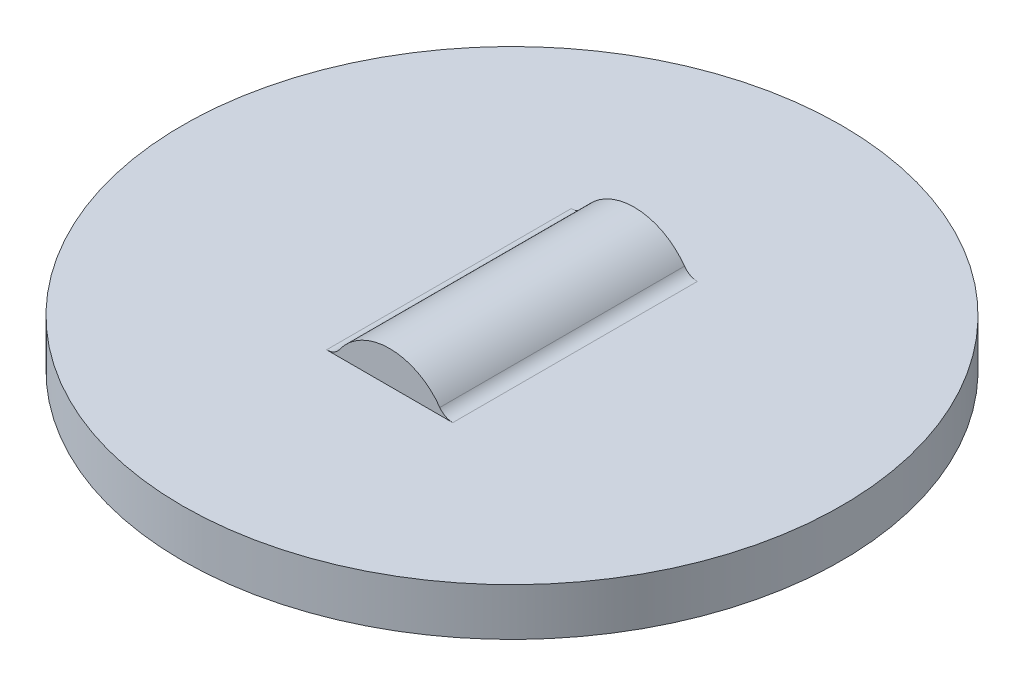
ISO-10303-21;
HEADER;
FILE_DESCRIPTION(('STEP AP214'),'2;1');
FILE_NAME('part.step','',(''),(''),'','','');
FILE_SCHEMA(('AUTOMOTIVE_DESIGN { 1 0 10303 214 1 1 1 1 }'));
ENDSEC;
DATA;
#1=APPLICATION_CONTEXT('core data for automotive mechanical design processes');
#2=APPLICATION_PROTOCOL_DEFINITION('international standard','automotive_design',2000,#1);
#3=PRODUCT_CONTEXT('',#1,'mechanical');
#4=PRODUCT('Part','Part','',(#3));
#5=PRODUCT_RELATED_PRODUCT_CATEGORY('part','',(#4));
#6=PRODUCT_DEFINITION_FORMATION('','',#4);
#7=PRODUCT_DEFINITION_CONTEXT('part definition',#1,'design');
#8=PRODUCT_DEFINITION('design','',#6,#7);
#9=PRODUCT_DEFINITION_SHAPE('','',#8);
#10=(LENGTH_UNIT() NAMED_UNIT(*) SI_UNIT(.MILLI.,.METRE.));
#11=(NAMED_UNIT(*) PLANE_ANGLE_UNIT() SI_UNIT($,.RADIAN.));
#12=(NAMED_UNIT(*) SI_UNIT($,.STERADIAN.) SOLID_ANGLE_UNIT());
#13=UNCERTAINTY_MEASURE_WITH_UNIT(LENGTH_MEASURE(1.E-05),#10,'distance_accuracy_value','');
#14=(GEOMETRIC_REPRESENTATION_CONTEXT(3) GLOBAL_UNCERTAINTY_ASSIGNED_CONTEXT((#13)) GLOBAL_UNIT_ASSIGNED_CONTEXT((#10,
#11,#12)) REPRESENTATION_CONTEXT('',''));
#15=CARTESIAN_POINT('',(0.,0.,0.));
#16=DIRECTION('',(0.,0.,1.));
#17=DIRECTION('',(1.,0.,0.));
#18=AXIS2_PLACEMENT_3D('',#15,#16,#17);
#19=CARTESIAN_POINT('',(0.,-1.38272671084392,11.7856));
#20=DIRECTION('',(0.,0.,-1.));
#21=DIRECTION('',(-1.,0.,0.));
#22=AXIS2_PLACEMENT_3D('',#19,#20,#21);
#23=CYLINDRICAL_SURFACE('',#22,0.671526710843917);
#24=DIRECTION('',(0.,0.,-1.));
#25=VECTOR('',#24,1.);
#26=CARTESIAN_POINT('',(0.5486491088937,-0.99551581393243,11.7856));
#27=LINE('',#26,#25);
#28=CARTESIAN_POINT('',(0.5486491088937,-0.99551581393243,11.7856));
#29=VERTEX_POINT('',#28);
#30=CARTESIAN_POINT('',(0.5486491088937,-0.99551581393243,0.));
#31=VERTEX_POINT('',#30);
#32=EDGE_CURVE('E92',#29,#31,#27,.T.);
#33=ORIENTED_EDGE('',*,*,#32,.F.);
#34=CARTESIAN_POINT('',(0.,-1.38272671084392,11.7856));
#35=DIRECTION('',(0.,0.,-1.));
#36=DIRECTION('',(-1.,0.,0.));
#37=AXIS2_PLACEMENT_3D('',#34,#35,#36);
#38=CIRCLE('',#37,0.671526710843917);
#39=CARTESIAN_POINT('',(-0.5486491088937,-0.995515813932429,11.7856));
#40=VERTEX_POINT('',#39);
#41=EDGE_CURVE('E20',#40,#29,#38,.T.);
#42=ORIENTED_EDGE('',*,*,#41,.F.);
#43=DIRECTION('',(0.,0.,-1.));
#44=VECTOR('',#43,1.);
#45=CARTESIAN_POINT('',(-0.5486491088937,-0.995515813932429,11.7856));
#46=LINE('',#45,#44);
#47=CARTESIAN_POINT('',(-0.5486491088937,-0.995515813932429,0.));
#48=VERTEX_POINT('',#47);
#49=EDGE_CURVE('E78',#48,#40,#46,.F.);
#50=ORIENTED_EDGE('',*,*,#49,.F.);
#51=CARTESIAN_POINT('',(0.,-1.38272671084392,0.));
#52=DIRECTION('',(0.,0.,-1.));
#53=DIRECTION('',(-1.,0.,0.));
#54=AXIS2_PLACEMENT_3D('',#51,#52,#53);
#55=CIRCLE('',#54,0.671526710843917);
#56=EDGE_CURVE('E108',#48,#31,#55,.T.);
#57=ORIENTED_EDGE('',*,*,#56,.T.);
#58=EDGE_LOOP('',(#33,#42,#50,#57));
#59=FACE_BOUND('',#58,.T.);
#60=ADVANCED_FACE('F17',(#59),#23,.F.);
#61=CARTESIAN_POINT('',(-3.0389186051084,0.,11.7856));
#62=DIRECTION('',(0.,0.,-1.));
#63=DIRECTION('',(-1.,0.,0.));
#64=AXIS2_PLACEMENT_3D('',#61,#62,#63);
#65=PLANE('',#64);
#66=ORIENTED_EDGE('',*,*,#41,.T.);
#67=CARTESIAN_POINT('',(3.0389186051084,0.762000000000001,11.7856));
#68=DIRECTION('',(0.,0.,-1.));
#69=DIRECTION('',(-1.,0.,0.));
#70=AXIS2_PLACEMENT_3D('',#67,#68,#69);
#71=CIRCLE('',#70,3.048);
#72=CARTESIAN_POINT('',(3.0389186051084,-2.286,11.7856));
#73=VERTEX_POINT('',#72);
#74=EDGE_CURVE('E96',#73,#29,#71,.T.);
#75=ORIENTED_EDGE('',*,*,#74,.F.);
#76=DIRECTION('',(1.,0.,0.));
#77=VECTOR('',#76,1.);
#78=CARTESIAN_POINT('',(-23.5906177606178,-2.286,11.7856));
#79=LINE('',#78,#77);
#80=CARTESIAN_POINT('',(-3.0389186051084,-2.286,11.7856));
#81=VERTEX_POINT('',#80);
#82=EDGE_CURVE('E99',#81,#73,#79,.T.);
#83=ORIENTED_EDGE('',*,*,#82,.F.);
#84=CARTESIAN_POINT('',(-3.0389186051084,0.762,11.7856));
#85=DIRECTION('',(0.,0.,-1.));
#86=DIRECTION('',(-1.,0.,0.));
#87=AXIS2_PLACEMENT_3D('',#84,#85,#86);
#88=CIRCLE('',#87,3.048);
#89=EDGE_CURVE('E83',#40,#81,#88,.T.);
#90=ORIENTED_EDGE('',*,*,#89,.F.);
#91=EDGE_LOOP('',(#66,#75,#83,#90));
#92=FACE_BOUND('',#91,.T.);
#93=ADVANCED_FACE('F98',(#92),#65,.T.);
#94=CARTESIAN_POINT('',(3.0389186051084,0.762000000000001,11.7856));
#95=DIRECTION('',(0.,0.,-1.));
#96=DIRECTION('',(-1.,0.,0.));
#97=AXIS2_PLACEMENT_3D('',#94,#95,#96);
#98=CYLINDRICAL_SURFACE('',#97,3.048);
#99=ORIENTED_EDGE('',*,*,#74,.T.);
#100=ORIENTED_EDGE('',*,*,#32,.T.);
#101=CARTESIAN_POINT('',(3.0389186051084,0.762000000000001,0.));
#102=DIRECTION('',(0.,0.,-1.));
#103=DIRECTION('',(-1.,0.,0.));
#104=AXIS2_PLACEMENT_3D('',#101,#102,#103);
#105=CIRCLE('',#104,3.048);
#106=CARTESIAN_POINT('',(3.0389186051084,-2.286,0.));
#107=VERTEX_POINT('',#106);
#108=EDGE_CURVE('E110',#31,#107,#105,.F.);
#109=ORIENTED_EDGE('',*,*,#108,.T.);
#110=DIRECTION('',(0.,0.,-1.));
#111=VECTOR('',#110,1.);
#112=CARTESIAN_POINT('',(3.0389186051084,-2.286,11.7856));
#113=LINE('',#112,#111);
#114=EDGE_CURVE('E101',#73,#107,#113,.T.);
#115=ORIENTED_EDGE('',*,*,#114,.F.);
#116=EDGE_LOOP('',(#99,#100,#109,#115));
#117=FACE_BOUND('',#116,.T.);
#118=ADVANCED_FACE('F155',(#117),#98,.T.);
#119=CARTESIAN_POINT('',(-3.0389186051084,0.,0.));
#120=DIRECTION('',(0.,0.,-1.));
#121=DIRECTION('',(-1.,0.,0.));
#122=AXIS2_PLACEMENT_3D('',#119,#120,#121);
#123=PLANE('',#122);
#124=CARTESIAN_POINT('',(-3.0389186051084,0.762,0.));
#125=DIRECTION('',(0.,0.,-1.));
#126=DIRECTION('',(-1.,0.,0.));
#127=AXIS2_PLACEMENT_3D('',#124,#125,#126);
#128=CIRCLE('',#127,3.048);
#129=CARTESIAN_POINT('',(-3.0389186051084,-2.286,0.));
#130=VERTEX_POINT('',#129);
#131=EDGE_CURVE('E86',#130,#48,#128,.F.);
#132=ORIENTED_EDGE('',*,*,#131,.F.);
#133=DIRECTION('',(1.,0.,0.));
#134=VECTOR('',#133,1.);
#135=CARTESIAN_POINT('',(-23.5906177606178,-2.286,0.));
#136=LINE('',#135,#134);
#137=EDGE_CURVE('E147',#107,#130,#136,.F.);
#138=ORIENTED_EDGE('',*,*,#137,.F.);
#139=ORIENTED_EDGE('',*,*,#108,.F.);
#140=ORIENTED_EDGE('',*,*,#56,.F.);
#141=EDGE_LOOP('',(#132,#138,#139,#140));
#142=FACE_BOUND('',#141,.T.);
#143=ADVANCED_FACE('F154',(#142),#123,.F.);
#144=CARTESIAN_POINT('',(-3.0389186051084,0.762,11.7856));
#145=DIRECTION('',(0.,0.,-1.));
#146=DIRECTION('',(-1.,0.,0.));
#147=AXIS2_PLACEMENT_3D('',#144,#145,#146);
#148=CYLINDRICAL_SURFACE('',#147,3.048);
#149=ORIENTED_EDGE('',*,*,#89,.T.);
#150=DIRECTION('',(0.,0.,-1.));
#151=VECTOR('',#150,1.);
#152=CARTESIAN_POINT('',(-3.0389186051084,-2.286,11.7856));
#153=LINE('',#152,#151);
#154=EDGE_CURVE('E142',#130,#81,#153,.F.);
#155=ORIENTED_EDGE('',*,*,#154,.F.);
#156=ORIENTED_EDGE('',*,*,#131,.T.);
#157=ORIENTED_EDGE('',*,*,#49,.T.);
#158=EDGE_LOOP('',(#149,#155,#156,#157));
#159=FACE_BOUND('',#158,.T.);
#160=ADVANCED_FACE('F80',(#159),#148,.T.);
#161=CARTESIAN_POINT('',(-23.5906177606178,-2.286,11.7856));
#162=DIRECTION('',(0.,-1.,0.));
#163=DIRECTION('',(0.,0.,-1.));
#164=AXIS2_PLACEMENT_3D('',#161,#162,#163);
#165=PLANE('',#164);
#166=ORIENTED_EDGE('',*,*,#137,.T.);
#167=ORIENTED_EDGE('',*,*,#154,.T.);
#168=ORIENTED_EDGE('',*,*,#82,.T.);
#169=ORIENTED_EDGE('',*,*,#114,.T.);
#170=EDGE_LOOP('',(#166,#167,#168,#169));
#171=FACE_BOUND('',#170,.T.);
#172=CARTESIAN_POINT('',(0.,-2.286,5.8928));
#173=DIRECTION('',(0.,-1.,0.));
#174=DIRECTION('',(0.,0.,-1.));
#175=AXIS2_PLACEMENT_3D('',#172,#173,#174);
#176=CIRCLE('',#175,15.875);
#177=CARTESIAN_POINT('',(0.,-2.286,-9.9822));
#178=VERTEX_POINT('',#177);
#179=EDGE_CURVE('E105',#178,#178,#176,.F.);
#180=ORIENTED_EDGE('',*,*,#179,.F.);
#181=EDGE_LOOP('',(#180));
#182=FACE_BOUND('',#181,.T.);
#183=ADVANCED_FACE('F150',(#171,#182),#165,.T.);
#184=CARTESIAN_POINT('',(0.,-1.38272671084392,11.7856));
#185=DIRECTION('',(0.,0.,-1.));
#186=DIRECTION('',(-1.,0.,0.));
#187=AXIS2_PLACEMENT_3D('',#184,#185,#186);
#188=CYLINDRICAL_SURFACE('',#187,2.95752671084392);
#189=CARTESIAN_POINT('',(0.,-1.38272671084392,11.7856));
#190=DIRECTION('',(0.,0.,-1.));
#191=DIRECTION('',(-1.,0.,0.));
#192=AXIS2_PLACEMENT_3D('',#189,#190,#191);
#193=CIRCLE('',#192,2.95752671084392);
#194=CARTESIAN_POINT('',(2.41635123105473,0.322621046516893,11.7856));
#195=VERTEX_POINT('',#194);
#196=CARTESIAN_POINT('',(-2.41635123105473,0.322621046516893,11.7856));
#197=VERTEX_POINT('',#196);
#198=EDGE_CURVE('E122',#195,#197,#193,.F.);
#199=ORIENTED_EDGE('',*,*,#198,.F.);
#200=DIRECTION('',(0.,0.,-1.));
#201=VECTOR('',#200,1.);
#202=CARTESIAN_POINT('',(2.41635123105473,0.322621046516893,11.7856));
#203=LINE('',#202,#201);
#204=CARTESIAN_POINT('',(2.41635123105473,0.322621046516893,0.));
#205=VERTEX_POINT('',#204);
#206=EDGE_CURVE('E133',#195,#205,#203,.T.);
#207=ORIENTED_EDGE('',*,*,#206,.T.);
#208=CARTESIAN_POINT('',(0.,-1.38272671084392,0.));
#209=DIRECTION('',(0.,0.,-1.));
#210=DIRECTION('',(-1.,0.,0.));
#211=AXIS2_PLACEMENT_3D('',#208,#209,#210);
#212=CIRCLE('',#211,2.95752671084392);
#213=CARTESIAN_POINT('',(-2.41635123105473,0.322621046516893,0.));
#214=VERTEX_POINT('',#213);
#215=EDGE_CURVE('E132',#214,#205,#212,.T.);
#216=ORIENTED_EDGE('',*,*,#215,.F.);
#217=DIRECTION('',(0.,0.,-1.));
#218=VECTOR('',#217,1.);
#219=CARTESIAN_POINT('',(-2.41635123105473,0.322621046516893,11.7856));
#220=LINE('',#219,#218);
#221=EDGE_CURVE('E130',#214,#197,#220,.F.);
#222=ORIENTED_EDGE('',*,*,#221,.T.);
#223=EDGE_LOOP('',(#199,#207,#216,#222));
#224=FACE_BOUND('',#223,.T.);
#225=ADVANCED_FACE('F190',(#224),#188,.T.);
#226=CARTESIAN_POINT('',(0.,0.,5.8928));
#227=DIRECTION('',(0.,-1.,0.));
#228=DIRECTION('',(0.,0.,-1.));
#229=AXIS2_PLACEMENT_3D('',#226,#227,#228);
#230=CYLINDRICAL_SURFACE('',#229,15.875);
#231=ORIENTED_EDGE('',*,*,#179,.T.);
#232=EDGE_LOOP('',(#231));
#233=FACE_BOUND('',#232,.T.);
#234=CARTESIAN_POINT('',(0.,0.,5.8928));
#235=DIRECTION('',(0.,-1.,0.));
#236=DIRECTION('',(0.,0.,-1.));
#237=AXIS2_PLACEMENT_3D('',#234,#235,#236);
#238=CIRCLE('',#237,15.875);
#239=CARTESIAN_POINT('',(0.,0.,-9.9822));
#240=VERTEX_POINT('',#239);
#241=EDGE_CURVE('E117',#240,#240,#238,.T.);
#242=ORIENTED_EDGE('',*,*,#241,.T.);
#243=EDGE_LOOP('',(#242));
#244=FACE_BOUND('',#243,.T.);
#245=ADVANCED_FACE('F186',(#233,#244),#230,.T.);
#246=CARTESIAN_POINT('',(3.0389186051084,0.762000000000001,11.7856));
#247=DIRECTION('',(0.,0.,-1.));
#248=DIRECTION('',(-1.,0.,0.));
#249=AXIS2_PLACEMENT_3D('',#246,#247,#248);
#250=CYLINDRICAL_SURFACE('',#249,0.762000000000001);
#251=ORIENTED_EDGE('',*,*,#206,.F.);
#252=CARTESIAN_POINT('',(3.0389186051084,0.762000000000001,11.7856));
#253=DIRECTION('',(0.,0.,-1.));
#254=DIRECTION('',(-1.,0.,0.));
#255=AXIS2_PLACEMENT_3D('',#252,#253,#254);
#256=CIRCLE('',#255,0.762000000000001);
#257=CARTESIAN_POINT('',(3.0389186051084,0.,11.7856));
#258=VERTEX_POINT('',#257);
#259=EDGE_CURVE('E124',#258,#195,#256,.T.);
#260=ORIENTED_EDGE('',*,*,#259,.F.);
#261=DIRECTION('',(0.,0.,-1.));
#262=VECTOR('',#261,1.);
#263=CARTESIAN_POINT('',(3.0389186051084,0.,11.7856));
#264=LINE('',#263,#262);
#265=CARTESIAN_POINT('',(3.0389186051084,0.,0.));
#266=VERTEX_POINT('',#265);
#267=EDGE_CURVE('E120',#258,#266,#264,.T.);
#268=ORIENTED_EDGE('',*,*,#267,.T.);
#269=CARTESIAN_POINT('',(3.0389186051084,0.762000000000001,0.));
#270=DIRECTION('',(0.,0.,-1.));
#271=DIRECTION('',(-1.,0.,0.));
#272=AXIS2_PLACEMENT_3D('',#269,#270,#271);
#273=CIRCLE('',#272,0.762000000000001);
#274=EDGE_CURVE('E131',#205,#266,#273,.F.);
#275=ORIENTED_EDGE('',*,*,#274,.F.);
#276=EDGE_LOOP('',(#251,#260,#268,#275));
#277=FACE_BOUND('',#276,.T.);
#278=ADVANCED_FACE('F183',(#277),#250,.F.);
#279=CARTESIAN_POINT('',(0.,-1.38272671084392,0.));
#280=DIRECTION('',(0.,0.,-1.));
#281=DIRECTION('',(-1.,0.,0.));
#282=AXIS2_PLACEMENT_3D('',#279,#280,#281);
#283=PLANE('',#282);
#284=ORIENTED_EDGE('',*,*,#215,.T.);
#285=ORIENTED_EDGE('',*,*,#274,.T.);
#286=DIRECTION('',(1.,0.,0.));
#287=VECTOR('',#286,1.);
#288=CARTESIAN_POINT('',(-23.5906177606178,0.,0.));
#289=LINE('',#288,#287);
#290=CARTESIAN_POINT('',(-3.0389186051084,0.,0.));
#291=VERTEX_POINT('',#290);
#292=EDGE_CURVE('E287',#266,#291,#289,.F.);
#293=ORIENTED_EDGE('',*,*,#292,.T.);
#294=CARTESIAN_POINT('',(-3.0389186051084,0.762,0.));
#295=DIRECTION('',(0.,0.,-1.));
#296=DIRECTION('',(-1.,0.,0.));
#297=AXIS2_PLACEMENT_3D('',#294,#295,#296);
#298=CIRCLE('',#297,0.762);
#299=EDGE_CURVE('E127',#291,#214,#298,.F.);
#300=ORIENTED_EDGE('',*,*,#299,.T.);
#301=EDGE_LOOP('',(#284,#285,#293,#300));
#302=FACE_BOUND('',#301,.T.);
#303=ADVANCED_FACE('F179',(#302),#283,.T.);
#304=CARTESIAN_POINT('',(-3.0389186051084,0.762,11.7856));
#305=DIRECTION('',(0.,0.,-1.));
#306=DIRECTION('',(-1.,0.,0.));
#307=AXIS2_PLACEMENT_3D('',#304,#305,#306);
#308=CYLINDRICAL_SURFACE('',#307,0.762);
#309=DIRECTION('',(0.,0.,-1.));
#310=VECTOR('',#309,1.);
#311=CARTESIAN_POINT('',(-3.0389186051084,0.,11.7856));
#312=LINE('',#311,#310);
#313=CARTESIAN_POINT('',(-3.0389186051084,0.,11.7856));
#314=VERTEX_POINT('',#313);
#315=EDGE_CURVE('E26',#291,#314,#312,.F.);
#316=ORIENTED_EDGE('',*,*,#315,.T.);
#317=CARTESIAN_POINT('',(-3.0389186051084,0.762,11.7856));
#318=DIRECTION('',(0.,0.,-1.));
#319=DIRECTION('',(-1.,0.,0.));
#320=AXIS2_PLACEMENT_3D('',#317,#318,#319);
#321=CIRCLE('',#320,0.762);
#322=EDGE_CURVE('E34',#197,#314,#321,.T.);
#323=ORIENTED_EDGE('',*,*,#322,.F.);
#324=ORIENTED_EDGE('',*,*,#221,.F.);
#325=ORIENTED_EDGE('',*,*,#299,.F.);
#326=EDGE_LOOP('',(#316,#323,#324,#325));
#327=FACE_BOUND('',#326,.T.);
#328=ADVANCED_FACE('F172',(#327),#308,.F.);
#329=CARTESIAN_POINT('',(3.0389186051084,0.762000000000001,11.7856));
#330=DIRECTION('',(0.,0.,1.));
#331=DIRECTION('',(1.,0.,0.));
#332=AXIS2_PLACEMENT_3D('',#329,#330,#331);
#333=PLANE('',#332);
#334=ORIENTED_EDGE('',*,*,#198,.T.);
#335=ORIENTED_EDGE('',*,*,#322,.T.);
#336=DIRECTION('',(1.,0.,0.));
#337=VECTOR('',#336,1.);
#338=CARTESIAN_POINT('',(-23.5906177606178,0.,11.7856));
#339=LINE('',#338,#337);
#340=EDGE_CURVE('E10',#314,#258,#339,.T.);
#341=ORIENTED_EDGE('',*,*,#340,.T.);
#342=ORIENTED_EDGE('',*,*,#259,.T.);
#343=EDGE_LOOP('',(#334,#335,#341,#342));
#344=FACE_BOUND('',#343,.T.);
#345=ADVANCED_FACE('F166',(#344),#333,.T.);
#346=CARTESIAN_POINT('',(-23.5906177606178,0.,11.7856));
#347=DIRECTION('',(0.,-1.,0.));
#348=DIRECTION('',(0.,0.,-1.));
#349=AXIS2_PLACEMENT_3D('',#346,#347,#348);
#350=PLANE('',#349);
#351=ORIENTED_EDGE('',*,*,#315,.F.);
#352=ORIENTED_EDGE('',*,*,#292,.F.);
#353=ORIENTED_EDGE('',*,*,#267,.F.);
#354=ORIENTED_EDGE('',*,*,#340,.F.);
#355=EDGE_LOOP('',(#351,#352,#353,#354));
#356=FACE_BOUND('',#355,.T.);
#357=ORIENTED_EDGE('',*,*,#241,.F.);
#358=EDGE_LOOP('',(#357));
#359=FACE_BOUND('',#358,.T.);
#360=ADVANCED_FACE('F164',(#356,#359),#350,.F.);
#361=CLOSED_SHELL('',(#60,#93,#118,#143,#160,#183,#225,#245,#278,#303,#328,#345,#360));
#362=MANIFOLD_SOLID_BREP('B1',#361);
#363=ADVANCED_BREP_SHAPE_REPRESENTATION('',(#18,#362),#14);
#364=SHAPE_DEFINITION_REPRESENTATION(#9,#363);
ENDSEC;
END-ISO-10303-21;
